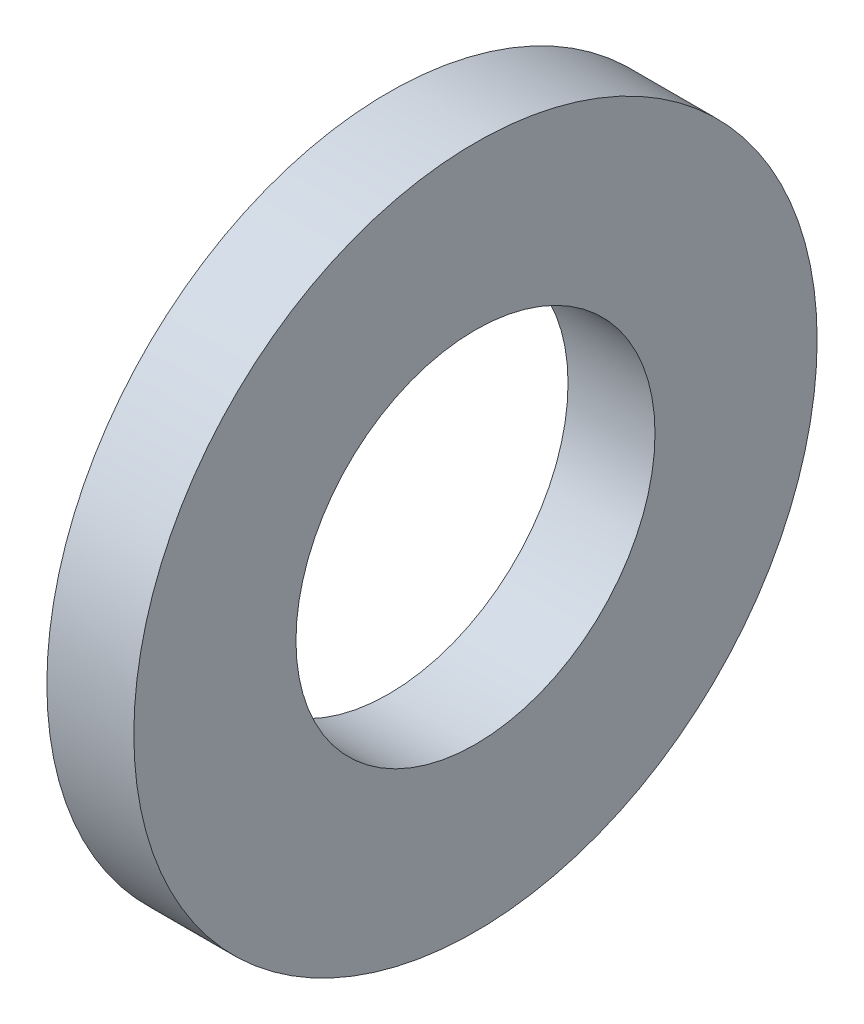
ISO-10303-21;
HEADER;
FILE_DESCRIPTION(('STEP AP214'),'2;1');
FILE_NAME('part.step','',(''),(''),'','','');
FILE_SCHEMA(('AUTOMOTIVE_DESIGN { 1 0 10303 214 1 1 1 1 }'));
ENDSEC;
DATA;
#1=APPLICATION_CONTEXT('core data for automotive mechanical design processes');
#2=APPLICATION_PROTOCOL_DEFINITION('international standard','automotive_design',2000,#1);
#3=PRODUCT_CONTEXT('',#1,'mechanical');
#4=PRODUCT('Part','Part','',(#3));
#5=PRODUCT_RELATED_PRODUCT_CATEGORY('part','',(#4));
#6=PRODUCT_DEFINITION_FORMATION('','',#4);
#7=PRODUCT_DEFINITION_CONTEXT('part definition',#1,'design');
#8=PRODUCT_DEFINITION('design','',#6,#7);
#9=PRODUCT_DEFINITION_SHAPE('','',#8);
#10=(LENGTH_UNIT() NAMED_UNIT(*) SI_UNIT(.MILLI.,.METRE.));
#11=(NAMED_UNIT(*) PLANE_ANGLE_UNIT() SI_UNIT($,.RADIAN.));
#12=(NAMED_UNIT(*) SI_UNIT($,.STERADIAN.) SOLID_ANGLE_UNIT());
#13=UNCERTAINTY_MEASURE_WITH_UNIT(LENGTH_MEASURE(1.E-05),#10,'distance_accuracy_value','');
#14=(GEOMETRIC_REPRESENTATION_CONTEXT(3) GLOBAL_UNCERTAINTY_ASSIGNED_CONTEXT((#13)) GLOBAL_UNIT_ASSIGNED_CONTEXT((#10,
#11,#12)) REPRESENTATION_CONTEXT('',''));
#15=CARTESIAN_POINT('',(0.,0.,0.));
#16=DIRECTION('',(0.,0.,1.));
#17=DIRECTION('',(1.,0.,0.));
#18=AXIS2_PLACEMENT_3D('',#15,#16,#17);
#19=CARTESIAN_POINT('',(-34.9249999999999,0.,0.));
#20=DIRECTION('',(-1.,0.,0.));
#21=DIRECTION('',(0.,0.,1.));
#22=AXIS2_PLACEMENT_3D('',#19,#20,#21);
#23=CYLINDRICAL_SURFACE('',#22,2.89);
#24=CARTESIAN_POINT('',(0.,0.,0.));
#25=DIRECTION('',(-1.,0.,0.));
#26=DIRECTION('',(0.,0.,1.));
#27=AXIS2_PLACEMENT_3D('',#24,#25,#26);
#28=CIRCLE('',#27,2.89);
#29=CARTESIAN_POINT('',(0.,0.,2.89));
#30=VERTEX_POINT('',#29);
#31=EDGE_CURVE('E10',#30,#30,#28,.T.);
#32=ORIENTED_EDGE('',*,*,#31,.F.);
#33=EDGE_LOOP('',(#32));
#34=FACE_BOUND('',#33,.T.);
#35=CARTESIAN_POINT('',(-1.4,0.,0.));
#36=DIRECTION('',(-1.,0.,0.));
#37=DIRECTION('',(0.,0.,1.));
#38=AXIS2_PLACEMENT_3D('',#35,#36,#37);
#39=CIRCLE('',#38,2.89);
#40=CARTESIAN_POINT('',(-1.4,0.,2.89));
#41=VERTEX_POINT('',#40);
#42=EDGE_CURVE('E42',#41,#41,#39,.T.);
#43=ORIENTED_EDGE('',*,*,#42,.T.);
#44=EDGE_LOOP('',(#43));
#45=FACE_BOUND('',#44,.T.);
#46=ADVANCED_FACE('F28',(#34,#45),#23,.F.);
#47=CARTESIAN_POINT('',(0.,2.89,0.));
#48=DIRECTION('',(-1.,0.,0.));
#49=DIRECTION('',(0.,0.,1.));
#50=AXIS2_PLACEMENT_3D('',#47,#48,#49);
#51=PLANE('',#50);
#52=CARTESIAN_POINT('',(0.,0.,0.));
#53=DIRECTION('',(-1.,0.,0.));
#54=DIRECTION('',(0.,0.,1.));
#55=AXIS2_PLACEMENT_3D('',#52,#53,#54);
#56=CIRCLE('',#55,5.5);
#57=CARTESIAN_POINT('',(0.,0.,5.5));
#58=VERTEX_POINT('',#57);
#59=EDGE_CURVE('E34',#58,#58,#56,.T.);
#60=ORIENTED_EDGE('',*,*,#59,.F.);
#61=EDGE_LOOP('',(#60));
#62=FACE_BOUND('',#61,.T.);
#63=ORIENTED_EDGE('',*,*,#31,.T.);
#64=EDGE_LOOP('',(#63));
#65=FACE_BOUND('',#64,.T.);
#66=ADVANCED_FACE('F57',(#62,#65),#51,.F.);
#67=CARTESIAN_POINT('',(-34.9249999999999,0.,0.));
#68=DIRECTION('',(-1.,0.,0.));
#69=DIRECTION('',(0.,0.,1.));
#70=AXIS2_PLACEMENT_3D('',#67,#68,#69);
#71=CYLINDRICAL_SURFACE('',#70,5.5);
#72=CARTESIAN_POINT('',(-1.4,0.,0.));
#73=DIRECTION('',(-1.,0.,0.));
#74=DIRECTION('',(0.,0.,1.));
#75=AXIS2_PLACEMENT_3D('',#72,#73,#74);
#76=CIRCLE('',#75,5.5);
#77=CARTESIAN_POINT('',(-1.4,0.,5.5));
#78=VERTEX_POINT('',#77);
#79=EDGE_CURVE('E38',#78,#78,#76,.T.);
#80=ORIENTED_EDGE('',*,*,#79,.F.);
#81=EDGE_LOOP('',(#80));
#82=FACE_BOUND('',#81,.T.);
#83=ORIENTED_EDGE('',*,*,#59,.T.);
#84=EDGE_LOOP('',(#83));
#85=FACE_BOUND('',#84,.T.);
#86=ADVANCED_FACE('F52',(#82,#85),#71,.T.);
#87=CARTESIAN_POINT('',(-1.4,5.5,0.));
#88=DIRECTION('',(1.,0.,0.));
#89=DIRECTION('',(0.,0.,-1.));
#90=AXIS2_PLACEMENT_3D('',#87,#88,#89);
#91=PLANE('',#90);
#92=ORIENTED_EDGE('',*,*,#42,.F.);
#93=EDGE_LOOP('',(#92));
#94=FACE_BOUND('',#93,.T.);
#95=ORIENTED_EDGE('',*,*,#79,.T.);
#96=EDGE_LOOP('',(#95));
#97=FACE_BOUND('',#96,.T.);
#98=ADVANCED_FACE('F49',(#94,#97),#91,.F.);
#99=CLOSED_SHELL('',(#46,#66,#86,#98));
#100=MANIFOLD_SOLID_BREP('B2',#99);
#101=ADVANCED_BREP_SHAPE_REPRESENTATION('',(#18,#100),#14);
#102=SHAPE_DEFINITION_REPRESENTATION(#9,#101);
ENDSEC;
END-ISO-10303-21;
